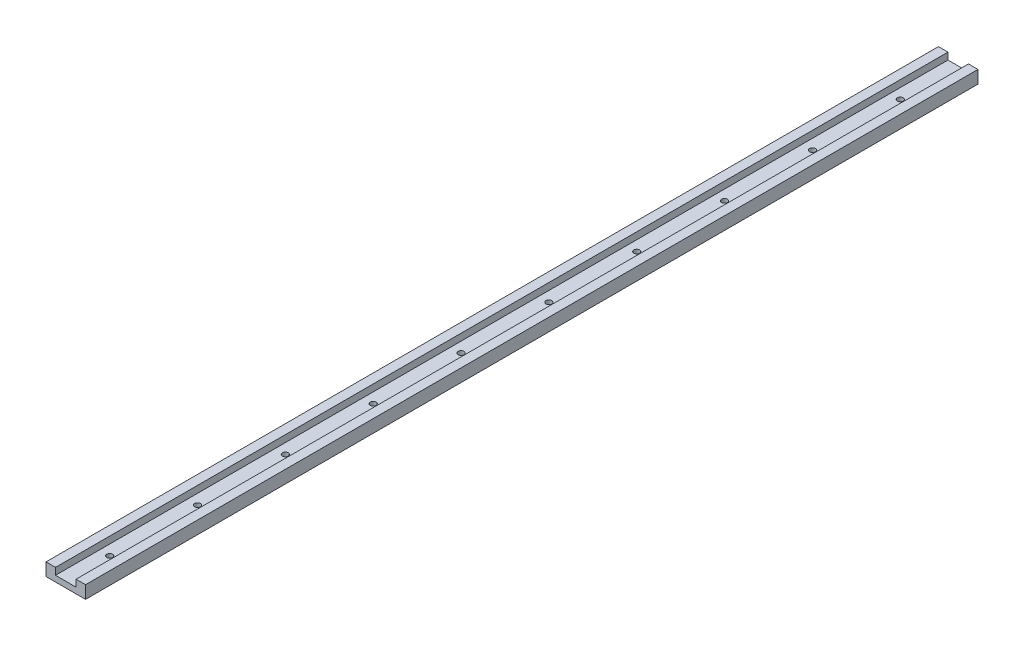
ISO-10303-21;
HEADER;
FILE_DESCRIPTION(('STEP AP214'),'2;1');
FILE_NAME('part.step','',(''),(''),'','','');
FILE_SCHEMA(('AUTOMOTIVE_DESIGN { 1 0 10303 214 1 1 1 1 }'));
ENDSEC;
DATA;
#1=APPLICATION_CONTEXT('core data for automotive mechanical design processes');
#2=APPLICATION_PROTOCOL_DEFINITION('international standard','automotive_design',2000,#1);
#3=PRODUCT_CONTEXT('',#1,'mechanical');
#4=PRODUCT('Part','Part','',(#3));
#5=PRODUCT_RELATED_PRODUCT_CATEGORY('part','',(#4));
#6=PRODUCT_DEFINITION_FORMATION('','',#4);
#7=PRODUCT_DEFINITION_CONTEXT('part definition',#1,'design');
#8=PRODUCT_DEFINITION('design','',#6,#7);
#9=PRODUCT_DEFINITION_SHAPE('','',#8);
#10=(LENGTH_UNIT() NAMED_UNIT(*) SI_UNIT(.MILLI.,.METRE.));
#11=(NAMED_UNIT(*) PLANE_ANGLE_UNIT() SI_UNIT($,.RADIAN.));
#12=(NAMED_UNIT(*) SI_UNIT($,.STERADIAN.) SOLID_ANGLE_UNIT());
#13=UNCERTAINTY_MEASURE_WITH_UNIT(LENGTH_MEASURE(1.E-05),#10,'distance_accuracy_value','');
#14=(GEOMETRIC_REPRESENTATION_CONTEXT(3) GLOBAL_UNCERTAINTY_ASSIGNED_CONTEXT((#13)) GLOBAL_UNIT_ASSIGNED_CONTEXT((#10,
#11,#12)) REPRESENTATION_CONTEXT('',''));
#15=CARTESIAN_POINT('',(0.,0.,0.));
#16=DIRECTION('',(0.,0.,1.));
#17=DIRECTION('',(1.,0.,0.));
#18=AXIS2_PLACEMENT_3D('',#15,#16,#17);
#19=CARTESIAN_POINT('',(13.5,-4.35,609.6));
#20=DIRECTION('',(-1.,0.,0.));
#21=DIRECTION('',(0.,-1.,0.));
#22=AXIS2_PLACEMENT_3D('',#19,#20,#21);
#23=PLANE('',#22);
#24=DIRECTION('',(0.,1.,0.));
#25=VECTOR('',#24,1.);
#26=CARTESIAN_POINT('',(13.5,-4.35,0.));
#27=LINE('',#26,#25);
#28=CARTESIAN_POINT('',(13.5,-4.35,0.));
#29=VERTEX_POINT('',#28);
#30=CARTESIAN_POINT('',(13.5,4.35,0.));
#31=VERTEX_POINT('',#30);
#32=EDGE_CURVE('E131',#29,#31,#27,.T.);
#33=ORIENTED_EDGE('',*,*,#32,.T.);
#34=DIRECTION('',(0.,0.,-1.));
#35=VECTOR('',#34,1.);
#36=CARTESIAN_POINT('',(13.5,4.35,609.6));
#37=LINE('',#36,#35);
#38=CARTESIAN_POINT('',(13.5,4.35,609.6));
#39=VERTEX_POINT('',#38);
#40=EDGE_CURVE('E159',#39,#31,#37,.T.);
#41=ORIENTED_EDGE('',*,*,#40,.F.);
#42=DIRECTION('',(0.,1.,0.));
#43=VECTOR('',#42,1.);
#44=CARTESIAN_POINT('',(13.5,-4.35,609.6));
#45=LINE('',#44,#43);
#46=CARTESIAN_POINT('',(13.5,-4.35,609.6));
#47=VERTEX_POINT('',#46);
#48=EDGE_CURVE('E146',#47,#39,#45,.T.);
#49=ORIENTED_EDGE('',*,*,#48,.F.);
#50=DIRECTION('',(0.,0.,-1.));
#51=VECTOR('',#50,1.);
#52=CARTESIAN_POINT('',(13.5,-4.35,609.6));
#53=LINE('',#52,#51);
#54=EDGE_CURVE('E127',#47,#29,#53,.T.);
#55=ORIENTED_EDGE('',*,*,#54,.T.);
#56=EDGE_LOOP('',(#33,#41,#49,#55));
#57=FACE_BOUND('',#56,.T.);
#58=ADVANCED_FACE('F33',(#57),#23,.F.);
#59=CARTESIAN_POINT('',(7.,4.35,609.6));
#60=DIRECTION('',(0.,-1.,0.));
#61=DIRECTION('',(1.,0.,0.));
#62=AXIS2_PLACEMENT_3D('',#59,#60,#61);
#63=PLANE('',#62);
#64=DIRECTION('',(-1.,0.,0.));
#65=VECTOR('',#64,1.);
#66=CARTESIAN_POINT('',(7.,4.35,0.));
#67=LINE('',#66,#65);
#68=CARTESIAN_POINT('',(7.,4.35,0.));
#69=VERTEX_POINT('',#68);
#70=EDGE_CURVE('E134',#31,#69,#67,.T.);
#71=ORIENTED_EDGE('',*,*,#70,.T.);
#72=DIRECTION('',(0.,0.,-1.));
#73=VECTOR('',#72,1.);
#74=CARTESIAN_POINT('',(7.,4.35,609.6));
#75=LINE('',#74,#73);
#76=CARTESIAN_POINT('',(7.,4.35,609.6));
#77=VERTEX_POINT('',#76);
#78=EDGE_CURVE('E156',#77,#69,#75,.T.);
#79=ORIENTED_EDGE('',*,*,#78,.F.);
#80=DIRECTION('',(-1.,0.,0.));
#81=VECTOR('',#80,1.);
#82=CARTESIAN_POINT('',(7.,4.35,609.6));
#83=LINE('',#82,#81);
#84=EDGE_CURVE('E94',#39,#77,#83,.T.);
#85=ORIENTED_EDGE('',*,*,#84,.F.);
#86=ORIENTED_EDGE('',*,*,#40,.T.);
#87=EDGE_LOOP('',(#71,#79,#85,#86));
#88=FACE_BOUND('',#87,.T.);
#89=ADVANCED_FACE('F224',(#88),#63,.F.);
#90=CARTESIAN_POINT('',(7.,4.35,609.6));
#91=DIRECTION('',(1.,0.,0.));
#92=DIRECTION('',(0.,1.,0.));
#93=AXIS2_PLACEMENT_3D('',#90,#91,#92);
#94=PLANE('',#93);
#95=DIRECTION('',(0.,-1.,0.));
#96=VECTOR('',#95,1.);
#97=CARTESIAN_POINT('',(7.,4.35,0.));
#98=LINE('',#97,#96);
#99=CARTESIAN_POINT('',(7.,-0.349999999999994,0.));
#100=VERTEX_POINT('',#99);
#101=EDGE_CURVE('E137',#69,#100,#98,.T.);
#102=ORIENTED_EDGE('',*,*,#101,.T.);
#103=DIRECTION('',(0.,0.,-1.));
#104=VECTOR('',#103,1.);
#105=CARTESIAN_POINT('',(7.,-0.349999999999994,609.6));
#106=LINE('',#105,#104);
#107=CARTESIAN_POINT('',(7.,-0.349999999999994,609.6));
#108=VERTEX_POINT('',#107);
#109=EDGE_CURVE('E153',#108,#100,#106,.T.);
#110=ORIENTED_EDGE('',*,*,#109,.F.);
#111=DIRECTION('',(0.,-1.,0.));
#112=VECTOR('',#111,1.);
#113=CARTESIAN_POINT('',(7.,4.35,609.6));
#114=LINE('',#113,#112);
#115=EDGE_CURVE('E401',#77,#108,#114,.T.);
#116=ORIENTED_EDGE('',*,*,#115,.F.);
#117=ORIENTED_EDGE('',*,*,#78,.T.);
#118=EDGE_LOOP('',(#102,#110,#116,#117));
#119=FACE_BOUND('',#118,.T.);
#120=ADVANCED_FACE('F215',(#119),#94,.F.);
#121=CARTESIAN_POINT('',(-7.,-0.349999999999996,609.6));
#122=DIRECTION('',(0.,-1.,0.));
#123=DIRECTION('',(1.,0.,0.));
#124=AXIS2_PLACEMENT_3D('',#121,#122,#123);
#125=PLANE('',#124);
#126=CARTESIAN_POINT('',(0.,-0.349999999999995,519.6));
#127=DIRECTION('',(0.,1.,0.));
#128=DIRECTION('',(-1.,0.,0.));
#129=AXIS2_PLACEMENT_3D('',#126,#127,#128);
#130=CIRCLE('',#129,2.);
#131=CARTESIAN_POINT('',(-2.,-0.349999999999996,519.6));
#132=VERTEX_POINT('',#131);
#133=EDGE_CURVE('E390',#132,#132,#130,.T.);
#134=ORIENTED_EDGE('',*,*,#133,.F.);
#135=EDGE_LOOP('',(#134));
#136=FACE_BOUND('',#135,.T.);
#137=CARTESIAN_POINT('',(0.,-0.349999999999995,579.6));
#138=DIRECTION('',(0.,1.,0.));
#139=DIRECTION('',(-1.,0.,0.));
#140=AXIS2_PLACEMENT_3D('',#137,#138,#139);
#141=CIRCLE('',#140,2.);
#142=CARTESIAN_POINT('',(-2.,-0.349999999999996,579.6));
#143=VERTEX_POINT('',#142);
#144=EDGE_CURVE('E391',#143,#143,#141,.T.);
#145=ORIENTED_EDGE('',*,*,#144,.F.);
#146=EDGE_LOOP('',(#145));
#147=FACE_BOUND('',#146,.T.);
#148=DIRECTION('',(-1.,0.,0.));
#149=VECTOR('',#148,1.);
#150=CARTESIAN_POINT('',(-7.,-0.349999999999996,0.));
#151=LINE('',#150,#149);
#152=CARTESIAN_POINT('',(-7.,-0.349999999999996,0.));
#153=VERTEX_POINT('',#152);
#154=EDGE_CURVE('E139',#100,#153,#151,.T.);
#155=ORIENTED_EDGE('',*,*,#154,.T.);
#156=DIRECTION('',(0.,0.,-1.));
#157=VECTOR('',#156,1.);
#158=CARTESIAN_POINT('',(-7.,-0.349999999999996,609.6));
#159=LINE('',#158,#157);
#160=CARTESIAN_POINT('',(-7.,-0.349999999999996,609.6));
#161=VERTEX_POINT('',#160);
#162=EDGE_CURVE('E150',#161,#153,#159,.T.);
#163=ORIENTED_EDGE('',*,*,#162,.F.);
#164=DIRECTION('',(-1.,0.,0.));
#165=VECTOR('',#164,1.);
#166=CARTESIAN_POINT('',(-7.,-0.349999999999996,609.6));
#167=LINE('',#166,#165);
#168=EDGE_CURVE('E403',#108,#161,#167,.T.);
#169=ORIENTED_EDGE('',*,*,#168,.F.);
#170=ORIENTED_EDGE('',*,*,#109,.T.);
#171=EDGE_LOOP('',(#155,#163,#169,#170));
#172=FACE_BOUND('',#171,.T.);
#173=CARTESIAN_POINT('',(0.,-0.349999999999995,459.6));
#174=DIRECTION('',(0.,1.,0.));
#175=DIRECTION('',(-1.,0.,0.));
#176=AXIS2_PLACEMENT_3D('',#173,#174,#175);
#177=CIRCLE('',#176,2.);
#178=CARTESIAN_POINT('',(-2.,-0.349999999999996,459.6));
#179=VERTEX_POINT('',#178);
#180=EDGE_CURVE('E164',#179,#179,#177,.T.);
#181=ORIENTED_EDGE('',*,*,#180,.F.);
#182=EDGE_LOOP('',(#181));
#183=FACE_BOUND('',#182,.T.);
#184=CARTESIAN_POINT('',(0.,-0.349999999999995,399.6));
#185=DIRECTION('',(0.,1.,0.));
#186=DIRECTION('',(-1.,0.,0.));
#187=AXIS2_PLACEMENT_3D('',#184,#185,#186);
#188=CIRCLE('',#187,2.);
#189=CARTESIAN_POINT('',(-2.,-0.349999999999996,399.6));
#190=VERTEX_POINT('',#189);
#191=EDGE_CURVE('E170',#190,#190,#188,.T.);
#192=ORIENTED_EDGE('',*,*,#191,.F.);
#193=EDGE_LOOP('',(#192));
#194=FACE_BOUND('',#193,.T.);
#195=CARTESIAN_POINT('',(0.,-0.349999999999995,339.6));
#196=DIRECTION('',(0.,1.,0.));
#197=DIRECTION('',(-1.,0.,0.));
#198=AXIS2_PLACEMENT_3D('',#195,#196,#197);
#199=CIRCLE('',#198,2.);
#200=CARTESIAN_POINT('',(-2.,-0.349999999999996,339.6));
#201=VERTEX_POINT('',#200);
#202=EDGE_CURVE('E176',#201,#201,#199,.T.);
#203=ORIENTED_EDGE('',*,*,#202,.F.);
#204=EDGE_LOOP('',(#203));
#205=FACE_BOUND('',#204,.T.);
#206=CARTESIAN_POINT('',(0.,-0.349999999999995,279.6));
#207=DIRECTION('',(0.,1.,0.));
#208=DIRECTION('',(-1.,0.,0.));
#209=AXIS2_PLACEMENT_3D('',#206,#207,#208);
#210=CIRCLE('',#209,2.);
#211=CARTESIAN_POINT('',(-2.,-0.349999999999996,279.6));
#212=VERTEX_POINT('',#211);
#213=EDGE_CURVE('E182',#212,#212,#210,.T.);
#214=ORIENTED_EDGE('',*,*,#213,.F.);
#215=EDGE_LOOP('',(#214));
#216=FACE_BOUND('',#215,.T.);
#217=CARTESIAN_POINT('',(0.,-0.349999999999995,219.6));
#218=DIRECTION('',(0.,1.,0.));
#219=DIRECTION('',(-1.,0.,0.));
#220=AXIS2_PLACEMENT_3D('',#217,#218,#219);
#221=CIRCLE('',#220,2.);
#222=CARTESIAN_POINT('',(-2.,-0.349999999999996,219.6));
#223=VERTEX_POINT('',#222);
#224=EDGE_CURVE('E188',#223,#223,#221,.T.);
#225=ORIENTED_EDGE('',*,*,#224,.F.);
#226=EDGE_LOOP('',(#225));
#227=FACE_BOUND('',#226,.T.);
#228=CARTESIAN_POINT('',(0.,-0.349999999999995,159.6));
#229=DIRECTION('',(0.,1.,0.));
#230=DIRECTION('',(-1.,0.,0.));
#231=AXIS2_PLACEMENT_3D('',#228,#229,#230);
#232=CIRCLE('',#231,2.);
#233=CARTESIAN_POINT('',(-2.,-0.349999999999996,159.6));
#234=VERTEX_POINT('',#233);
#235=EDGE_CURVE('E194',#234,#234,#232,.T.);
#236=ORIENTED_EDGE('',*,*,#235,.F.);
#237=EDGE_LOOP('',(#236));
#238=FACE_BOUND('',#237,.T.);
#239=CARTESIAN_POINT('',(0.,-0.349999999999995,99.6000000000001));
#240=DIRECTION('',(0.,1.,0.));
#241=DIRECTION('',(-1.,0.,0.));
#242=AXIS2_PLACEMENT_3D('',#239,#240,#241);
#243=CIRCLE('',#242,2.);
#244=CARTESIAN_POINT('',(-2.,-0.349999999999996,99.6000000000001));
#245=VERTEX_POINT('',#244);
#246=EDGE_CURVE('E200',#245,#245,#243,.T.);
#247=ORIENTED_EDGE('',*,*,#246,.F.);
#248=EDGE_LOOP('',(#247));
#249=FACE_BOUND('',#248,.T.);
#250=CARTESIAN_POINT('',(0.,-0.349999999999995,39.6));
#251=DIRECTION('',(0.,1.,0.));
#252=DIRECTION('',(-1.,0.,0.));
#253=AXIS2_PLACEMENT_3D('',#250,#251,#252);
#254=CIRCLE('',#253,2.);
#255=CARTESIAN_POINT('',(-2.,-0.349999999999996,39.6));
#256=VERTEX_POINT('',#255);
#257=EDGE_CURVE('E11',#256,#256,#254,.T.);
#258=ORIENTED_EDGE('',*,*,#257,.F.);
#259=EDGE_LOOP('',(#258));
#260=FACE_BOUND('',#259,.T.);
#261=ADVANCED_FACE('F212',(#136,#147,#172,#183,#194,#205,#216,#227,#238,#249,#260),#125,.F.);
#262=CARTESIAN_POINT('',(-7.,4.35,609.6));
#263=DIRECTION('',(-1.,0.,0.));
#264=DIRECTION('',(0.,-1.,0.));
#265=AXIS2_PLACEMENT_3D('',#262,#263,#264);
#266=PLANE('',#265);
#267=DIRECTION('',(0.,1.,0.));
#268=VECTOR('',#267,1.);
#269=CARTESIAN_POINT('',(-7.,4.35,0.));
#270=LINE('',#269,#268);
#271=CARTESIAN_POINT('',(-7.,4.35,0.));
#272=VERTEX_POINT('',#271);
#273=EDGE_CURVE('E141',#153,#272,#270,.T.);
#274=ORIENTED_EDGE('',*,*,#273,.T.);
#275=DIRECTION('',(0.,0.,-1.));
#276=VECTOR('',#275,1.);
#277=CARTESIAN_POINT('',(-7.,4.35,609.6));
#278=LINE('',#277,#276);
#279=CARTESIAN_POINT('',(-7.,4.35,609.6));
#280=VERTEX_POINT('',#279);
#281=EDGE_CURVE('E122',#280,#272,#278,.T.);
#282=ORIENTED_EDGE('',*,*,#281,.F.);
#283=DIRECTION('',(0.,1.,0.));
#284=VECTOR('',#283,1.);
#285=CARTESIAN_POINT('',(-7.,4.35,609.6));
#286=LINE('',#285,#284);
#287=EDGE_CURVE('E113',#161,#280,#286,.T.);
#288=ORIENTED_EDGE('',*,*,#287,.F.);
#289=ORIENTED_EDGE('',*,*,#162,.T.);
#290=EDGE_LOOP('',(#274,#282,#288,#289));
#291=FACE_BOUND('',#290,.T.);
#292=ADVANCED_FACE('F214',(#291),#266,.F.);
#293=CARTESIAN_POINT('',(-13.5,4.35,609.6));
#294=DIRECTION('',(0.,-1.,0.));
#295=DIRECTION('',(0.,0.,-1.));
#296=AXIS2_PLACEMENT_3D('',#293,#294,#295);
#297=PLANE('',#296);
#298=DIRECTION('',(-1.,0.,0.));
#299=VECTOR('',#298,1.);
#300=CARTESIAN_POINT('',(-13.5,4.35,0.));
#301=LINE('',#300,#299);
#302=CARTESIAN_POINT('',(-13.5,4.35,0.));
#303=VERTEX_POINT('',#302);
#304=EDGE_CURVE('E121',#272,#303,#301,.T.);
#305=ORIENTED_EDGE('',*,*,#304,.T.);
#306=DIRECTION('',(0.,0.,-1.));
#307=VECTOR('',#306,1.);
#308=CARTESIAN_POINT('',(-13.5,4.35,609.6));
#309=LINE('',#308,#307);
#310=CARTESIAN_POINT('',(-13.5,4.35,609.6));
#311=VERTEX_POINT('',#310);
#312=EDGE_CURVE('E118',#311,#303,#309,.T.);
#313=ORIENTED_EDGE('',*,*,#312,.F.);
#314=DIRECTION('',(-1.,0.,0.));
#315=VECTOR('',#314,1.);
#316=CARTESIAN_POINT('',(-13.5,4.35,609.6));
#317=LINE('',#316,#315);
#318=EDGE_CURVE('E107',#280,#311,#317,.T.);
#319=ORIENTED_EDGE('',*,*,#318,.F.);
#320=ORIENTED_EDGE('',*,*,#281,.T.);
#321=EDGE_LOOP('',(#305,#313,#319,#320));
#322=FACE_BOUND('',#321,.T.);
#323=ADVANCED_FACE('F119',(#322),#297,.F.);
#324=CARTESIAN_POINT('',(-13.5,-4.35,609.6));
#325=DIRECTION('',(1.,0.,0.));
#326=DIRECTION('',(0.,0.,-1.));
#327=AXIS2_PLACEMENT_3D('',#324,#325,#326);
#328=PLANE('',#327);
#329=DIRECTION('',(0.,-1.,0.));
#330=VECTOR('',#329,1.);
#331=CARTESIAN_POINT('',(-13.5,-4.35,0.));
#332=LINE('',#331,#330);
#333=CARTESIAN_POINT('',(-13.5,-4.35,0.));
#334=VERTEX_POINT('',#333);
#335=EDGE_CURVE('E79',#303,#334,#332,.T.);
#336=ORIENTED_EDGE('',*,*,#335,.T.);
#337=DIRECTION('',(0.,0.,-1.));
#338=VECTOR('',#337,1.);
#339=CARTESIAN_POINT('',(-13.5,-4.35,609.6));
#340=LINE('',#339,#338);
#341=CARTESIAN_POINT('',(-13.5,-4.35,609.6));
#342=VERTEX_POINT('',#341);
#343=EDGE_CURVE('E123',#342,#334,#340,.T.);
#344=ORIENTED_EDGE('',*,*,#343,.F.);
#345=DIRECTION('',(0.,-1.,0.));
#346=VECTOR('',#345,1.);
#347=CARTESIAN_POINT('',(-13.5,-4.35,609.6));
#348=LINE('',#347,#346);
#349=EDGE_CURVE('E111',#311,#342,#348,.T.);
#350=ORIENTED_EDGE('',*,*,#349,.F.);
#351=ORIENTED_EDGE('',*,*,#312,.T.);
#352=EDGE_LOOP('',(#336,#344,#350,#351));
#353=FACE_BOUND('',#352,.T.);
#354=ADVANCED_FACE('F125',(#353),#328,.F.);
#355=CARTESIAN_POINT('',(-13.5,-4.35,609.6));
#356=DIRECTION('',(0.,1.,0.));
#357=DIRECTION('',(0.,0.,1.));
#358=AXIS2_PLACEMENT_3D('',#355,#356,#357);
#359=PLANE('',#358);
#360=CARTESIAN_POINT('',(0.,-4.35,519.6));
#361=DIRECTION('',(0.,1.,0.));
#362=DIRECTION('',(-1.,0.,0.));
#363=AXIS2_PLACEMENT_3D('',#360,#361,#362);
#364=CIRCLE('',#363,2.);
#365=CARTESIAN_POINT('',(-2.,-4.35,519.6));
#366=VERTEX_POINT('',#365);
#367=EDGE_CURVE('E388',#366,#366,#364,.T.);
#368=ORIENTED_EDGE('',*,*,#367,.T.);
#369=EDGE_LOOP('',(#368));
#370=FACE_BOUND('',#369,.T.);
#371=CARTESIAN_POINT('',(0.,-4.35,579.6));
#372=DIRECTION('',(0.,1.,0.));
#373=DIRECTION('',(-1.,0.,0.));
#374=AXIS2_PLACEMENT_3D('',#371,#372,#373);
#375=CIRCLE('',#374,2.);
#376=CARTESIAN_POINT('',(-2.,-4.35,579.6));
#377=VERTEX_POINT('',#376);
#378=EDGE_CURVE('E135',#377,#377,#375,.T.);
#379=ORIENTED_EDGE('',*,*,#378,.T.);
#380=EDGE_LOOP('',(#379));
#381=FACE_BOUND('',#380,.T.);
#382=DIRECTION('',(1.,0.,0.));
#383=VECTOR('',#382,1.);
#384=CARTESIAN_POINT('',(-13.5,-4.35,0.));
#385=LINE('',#384,#383);
#386=EDGE_CURVE('E85',#334,#29,#385,.T.);
#387=ORIENTED_EDGE('',*,*,#386,.T.);
#388=ORIENTED_EDGE('',*,*,#54,.F.);
#389=DIRECTION('',(1.,0.,0.));
#390=VECTOR('',#389,1.);
#391=CARTESIAN_POINT('',(-13.5,-4.35,609.6));
#392=LINE('',#391,#390);
#393=EDGE_CURVE('E50',#342,#47,#392,.T.);
#394=ORIENTED_EDGE('',*,*,#393,.F.);
#395=ORIENTED_EDGE('',*,*,#343,.T.);
#396=EDGE_LOOP('',(#387,#388,#394,#395));
#397=FACE_BOUND('',#396,.T.);
#398=CARTESIAN_POINT('',(0.,-4.35,459.6));
#399=DIRECTION('',(0.,1.,0.));
#400=DIRECTION('',(-1.,0.,0.));
#401=AXIS2_PLACEMENT_3D('',#398,#399,#400);
#402=CIRCLE('',#401,2.);
#403=CARTESIAN_POINT('',(-2.,-4.35,459.6));
#404=VERTEX_POINT('',#403);
#405=EDGE_CURVE('E161',#404,#404,#402,.T.);
#406=ORIENTED_EDGE('',*,*,#405,.T.);
#407=EDGE_LOOP('',(#406));
#408=FACE_BOUND('',#407,.T.);
#409=CARTESIAN_POINT('',(0.,-4.35,399.6));
#410=DIRECTION('',(0.,1.,0.));
#411=DIRECTION('',(-1.,0.,0.));
#412=AXIS2_PLACEMENT_3D('',#409,#410,#411);
#413=CIRCLE('',#412,2.);
#414=CARTESIAN_POINT('',(-2.,-4.35,399.6));
#415=VERTEX_POINT('',#414);
#416=EDGE_CURVE('E167',#415,#415,#413,.T.);
#417=ORIENTED_EDGE('',*,*,#416,.T.);
#418=EDGE_LOOP('',(#417));
#419=FACE_BOUND('',#418,.T.);
#420=CARTESIAN_POINT('',(0.,-4.35,339.6));
#421=DIRECTION('',(0.,1.,0.));
#422=DIRECTION('',(-1.,0.,0.));
#423=AXIS2_PLACEMENT_3D('',#420,#421,#422);
#424=CIRCLE('',#423,2.);
#425=CARTESIAN_POINT('',(-2.,-4.35,339.6));
#426=VERTEX_POINT('',#425);
#427=EDGE_CURVE('E173',#426,#426,#424,.T.);
#428=ORIENTED_EDGE('',*,*,#427,.T.);
#429=EDGE_LOOP('',(#428));
#430=FACE_BOUND('',#429,.T.);
#431=CARTESIAN_POINT('',(0.,-4.35,279.6));
#432=DIRECTION('',(0.,1.,0.));
#433=DIRECTION('',(-1.,0.,0.));
#434=AXIS2_PLACEMENT_3D('',#431,#432,#433);
#435=CIRCLE('',#434,2.);
#436=CARTESIAN_POINT('',(-2.,-4.35,279.6));
#437=VERTEX_POINT('',#436);
#438=EDGE_CURVE('E179',#437,#437,#435,.T.);
#439=ORIENTED_EDGE('',*,*,#438,.T.);
#440=EDGE_LOOP('',(#439));
#441=FACE_BOUND('',#440,.T.);
#442=CARTESIAN_POINT('',(0.,-4.35,219.6));
#443=DIRECTION('',(0.,1.,0.));
#444=DIRECTION('',(-1.,0.,0.));
#445=AXIS2_PLACEMENT_3D('',#442,#443,#444);
#446=CIRCLE('',#445,2.);
#447=CARTESIAN_POINT('',(-2.,-4.35,219.6));
#448=VERTEX_POINT('',#447);
#449=EDGE_CURVE('E185',#448,#448,#446,.T.);
#450=ORIENTED_EDGE('',*,*,#449,.T.);
#451=EDGE_LOOP('',(#450));
#452=FACE_BOUND('',#451,.T.);
#453=CARTESIAN_POINT('',(0.,-4.35,159.6));
#454=DIRECTION('',(0.,1.,0.));
#455=DIRECTION('',(-1.,0.,0.));
#456=AXIS2_PLACEMENT_3D('',#453,#454,#455);
#457=CIRCLE('',#456,2.);
#458=CARTESIAN_POINT('',(-2.,-4.35,159.6));
#459=VERTEX_POINT('',#458);
#460=EDGE_CURVE('E191',#459,#459,#457,.T.);
#461=ORIENTED_EDGE('',*,*,#460,.T.);
#462=EDGE_LOOP('',(#461));
#463=FACE_BOUND('',#462,.T.);
#464=CARTESIAN_POINT('',(0.,-4.35,99.6000000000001));
#465=DIRECTION('',(0.,1.,0.));
#466=DIRECTION('',(-1.,0.,0.));
#467=AXIS2_PLACEMENT_3D('',#464,#465,#466);
#468=CIRCLE('',#467,2.);
#469=CARTESIAN_POINT('',(-2.,-4.35,99.6000000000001));
#470=VERTEX_POINT('',#469);
#471=EDGE_CURVE('E197',#470,#470,#468,.T.);
#472=ORIENTED_EDGE('',*,*,#471,.T.);
#473=EDGE_LOOP('',(#472));
#474=FACE_BOUND('',#473,.T.);
#475=CARTESIAN_POINT('',(0.,-4.35,39.6));
#476=DIRECTION('',(0.,1.,0.));
#477=DIRECTION('',(-1.,0.,0.));
#478=AXIS2_PLACEMENT_3D('',#475,#476,#477);
#479=CIRCLE('',#478,2.);
#480=CARTESIAN_POINT('',(-2.,-4.35,39.6));
#481=VERTEX_POINT('',#480);
#482=EDGE_CURVE('E42',#481,#481,#479,.T.);
#483=ORIENTED_EDGE('',*,*,#482,.T.);
#484=EDGE_LOOP('',(#483));
#485=FACE_BOUND('',#484,.T.);
#486=ADVANCED_FACE('F205',(#370,#381,#397,#408,#419,#430,#441,#452,#463,#474,#485),#359,.F.);
#487=CARTESIAN_POINT('',(0.,0.,609.6));
#488=DIRECTION('',(0.,0.,-1.));
#489=DIRECTION('',(-1.,0.,0.));
#490=AXIS2_PLACEMENT_3D('',#487,#488,#489);
#491=PLANE('',#490);
#492=ORIENTED_EDGE('',*,*,#48,.T.);
#493=ORIENTED_EDGE('',*,*,#84,.T.);
#494=ORIENTED_EDGE('',*,*,#115,.T.);
#495=ORIENTED_EDGE('',*,*,#168,.T.);
#496=ORIENTED_EDGE('',*,*,#287,.T.);
#497=ORIENTED_EDGE('',*,*,#318,.T.);
#498=ORIENTED_EDGE('',*,*,#349,.T.);
#499=ORIENTED_EDGE('',*,*,#393,.T.);
#500=EDGE_LOOP('',(#492,#493,#494,#495,#496,#497,#498,#499));
#501=FACE_BOUND('',#500,.T.);
#502=ADVANCED_FACE('F109',(#501),#491,.F.);
#503=CARTESIAN_POINT('',(0.,0.,0.));
#504=DIRECTION('',(0.,0.,-1.));
#505=DIRECTION('',(-1.,0.,0.));
#506=AXIS2_PLACEMENT_3D('',#503,#504,#505);
#507=PLANE('',#506);
#508=ORIENTED_EDGE('',*,*,#32,.F.);
#509=ORIENTED_EDGE('',*,*,#386,.F.);
#510=ORIENTED_EDGE('',*,*,#335,.F.);
#511=ORIENTED_EDGE('',*,*,#304,.F.);
#512=ORIENTED_EDGE('',*,*,#273,.F.);
#513=ORIENTED_EDGE('',*,*,#154,.F.);
#514=ORIENTED_EDGE('',*,*,#101,.F.);
#515=ORIENTED_EDGE('',*,*,#70,.F.);
#516=EDGE_LOOP('',(#508,#509,#510,#511,#512,#513,#514,#515));
#517=FACE_BOUND('',#516,.T.);
#518=ADVANCED_FACE('F277',(#517),#507,.T.);
#519=CARTESIAN_POINT('',(0.,-4.35,579.6));
#520=DIRECTION('',(0.,1.,0.));
#521=DIRECTION('',(-1.,0.,0.));
#522=AXIS2_PLACEMENT_3D('',#519,#520,#521);
#523=CYLINDRICAL_SURFACE('',#522,2.);
#524=ORIENTED_EDGE('',*,*,#378,.F.);
#525=EDGE_LOOP('',(#524));
#526=FACE_BOUND('',#525,.T.);
#527=ORIENTED_EDGE('',*,*,#144,.T.);
#528=EDGE_LOOP('',(#527));
#529=FACE_BOUND('',#528,.T.);
#530=ADVANCED_FACE('F309',(#526,#529),#523,.F.);
#531=CARTESIAN_POINT('',(0.,-4.35,519.6));
#532=DIRECTION('',(0.,1.,0.));
#533=DIRECTION('',(-1.,0.,0.));
#534=AXIS2_PLACEMENT_3D('',#531,#532,#533);
#535=CYLINDRICAL_SURFACE('',#534,2.);
#536=ORIENTED_EDGE('',*,*,#367,.F.);
#537=EDGE_LOOP('',(#536));
#538=FACE_BOUND('',#537,.T.);
#539=ORIENTED_EDGE('',*,*,#133,.T.);
#540=EDGE_LOOP('',(#539));
#541=FACE_BOUND('',#540,.T.);
#542=ADVANCED_FACE('F241',(#538,#541),#535,.F.);
#543=CARTESIAN_POINT('',(0.,-4.35,459.6));
#544=DIRECTION('',(0.,1.,0.));
#545=DIRECTION('',(-1.,0.,0.));
#546=AXIS2_PLACEMENT_3D('',#543,#544,#545);
#547=CYLINDRICAL_SURFACE('',#546,2.);
#548=ORIENTED_EDGE('',*,*,#405,.F.);
#549=EDGE_LOOP('',(#548));
#550=FACE_BOUND('',#549,.T.);
#551=ORIENTED_EDGE('',*,*,#180,.T.);
#552=EDGE_LOOP('',(#551));
#553=FACE_BOUND('',#552,.T.);
#554=ADVANCED_FACE('F237',(#550,#553),#547,.F.);
#555=CARTESIAN_POINT('',(0.,-4.35,399.6));
#556=DIRECTION('',(0.,1.,0.));
#557=DIRECTION('',(-1.,0.,0.));
#558=AXIS2_PLACEMENT_3D('',#555,#556,#557);
#559=CYLINDRICAL_SURFACE('',#558,2.);
#560=ORIENTED_EDGE('',*,*,#416,.F.);
#561=EDGE_LOOP('',(#560));
#562=FACE_BOUND('',#561,.T.);
#563=ORIENTED_EDGE('',*,*,#191,.T.);
#564=EDGE_LOOP('',(#563));
#565=FACE_BOUND('',#564,.T.);
#566=ADVANCED_FACE('F240',(#562,#565),#559,.F.);
#567=CARTESIAN_POINT('',(0.,-4.35,339.6));
#568=DIRECTION('',(0.,1.,0.));
#569=DIRECTION('',(-1.,0.,0.));
#570=AXIS2_PLACEMENT_3D('',#567,#568,#569);
#571=CYLINDRICAL_SURFACE('',#570,2.);
#572=ORIENTED_EDGE('',*,*,#427,.F.);
#573=EDGE_LOOP('',(#572));
#574=FACE_BOUND('',#573,.T.);
#575=ORIENTED_EDGE('',*,*,#202,.T.);
#576=EDGE_LOOP('',(#575));
#577=FACE_BOUND('',#576,.T.);
#578=ADVANCED_FACE('F245',(#574,#577),#571,.F.);
#579=CARTESIAN_POINT('',(0.,-4.35,279.6));
#580=DIRECTION('',(0.,1.,0.));
#581=DIRECTION('',(-1.,0.,0.));
#582=AXIS2_PLACEMENT_3D('',#579,#580,#581);
#583=CYLINDRICAL_SURFACE('',#582,2.);
#584=ORIENTED_EDGE('',*,*,#438,.F.);
#585=EDGE_LOOP('',(#584));
#586=FACE_BOUND('',#585,.T.);
#587=ORIENTED_EDGE('',*,*,#213,.T.);
#588=EDGE_LOOP('',(#587));
#589=FACE_BOUND('',#588,.T.);
#590=ADVANCED_FACE('F249',(#586,#589),#583,.F.);
#591=CARTESIAN_POINT('',(0.,-4.35,219.6));
#592=DIRECTION('',(0.,1.,0.));
#593=DIRECTION('',(-1.,0.,0.));
#594=AXIS2_PLACEMENT_3D('',#591,#592,#593);
#595=CYLINDRICAL_SURFACE('',#594,2.);
#596=ORIENTED_EDGE('',*,*,#449,.F.);
#597=EDGE_LOOP('',(#596));
#598=FACE_BOUND('',#597,.T.);
#599=ORIENTED_EDGE('',*,*,#224,.T.);
#600=EDGE_LOOP('',(#599));
#601=FACE_BOUND('',#600,.T.);
#602=ADVANCED_FACE('F253',(#598,#601),#595,.F.);
#603=CARTESIAN_POINT('',(0.,-4.35,159.6));
#604=DIRECTION('',(0.,1.,0.));
#605=DIRECTION('',(-1.,0.,0.));
#606=AXIS2_PLACEMENT_3D('',#603,#604,#605);
#607=CYLINDRICAL_SURFACE('',#606,2.);
#608=ORIENTED_EDGE('',*,*,#460,.F.);
#609=EDGE_LOOP('',(#608));
#610=FACE_BOUND('',#609,.T.);
#611=ORIENTED_EDGE('',*,*,#235,.T.);
#612=EDGE_LOOP('',(#611));
#613=FACE_BOUND('',#612,.T.);
#614=ADVANCED_FACE('F257',(#610,#613),#607,.F.);
#615=CARTESIAN_POINT('',(0.,-4.35,99.6000000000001));
#616=DIRECTION('',(0.,1.,0.));
#617=DIRECTION('',(-1.,0.,0.));
#618=AXIS2_PLACEMENT_3D('',#615,#616,#617);
#619=CYLINDRICAL_SURFACE('',#618,2.);
#620=ORIENTED_EDGE('',*,*,#471,.F.);
#621=EDGE_LOOP('',(#620));
#622=FACE_BOUND('',#621,.T.);
#623=ORIENTED_EDGE('',*,*,#246,.T.);
#624=EDGE_LOOP('',(#623));
#625=FACE_BOUND('',#624,.T.);
#626=ADVANCED_FACE('F209',(#622,#625),#619,.F.);
#627=CARTESIAN_POINT('',(0.,-4.35,39.6));
#628=DIRECTION('',(0.,1.,0.));
#629=DIRECTION('',(-1.,0.,0.));
#630=AXIS2_PLACEMENT_3D('',#627,#628,#629);
#631=CYLINDRICAL_SURFACE('',#630,2.);
#632=ORIENTED_EDGE('',*,*,#482,.F.);
#633=EDGE_LOOP('',(#632));
#634=FACE_BOUND('',#633,.T.);
#635=ORIENTED_EDGE('',*,*,#257,.T.);
#636=EDGE_LOOP('',(#635));
#637=FACE_BOUND('',#636,.T.);
#638=ADVANCED_FACE('F35',(#634,#637),#631,.F.);
#639=CLOSED_SHELL('',(#58,#89,#120,#261,#292,#323,#354,#486,#502,#518,#530,#542,#554,#566,#578,
#590,#602,#614,#626,#638));
#640=MANIFOLD_SOLID_BREP('B2',#639);
#641=ADVANCED_BREP_SHAPE_REPRESENTATION('',(#18,#640),#14);
#642=SHAPE_DEFINITION_REPRESENTATION(#9,#641);
ENDSEC;
END-ISO-10303-21;
